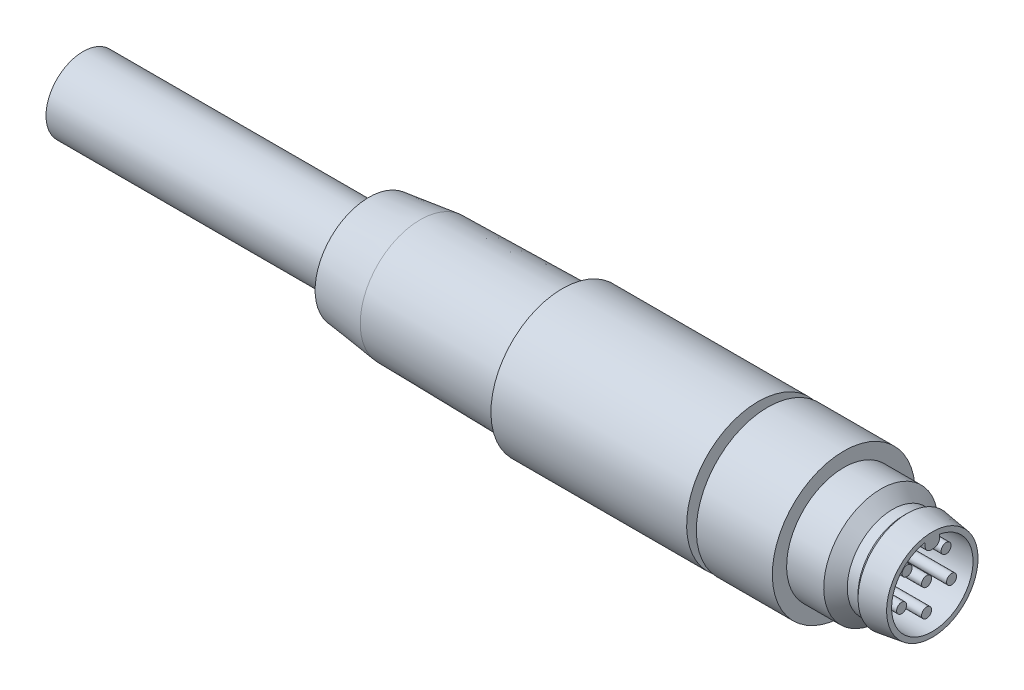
ISO-10303-21;
HEADER;
FILE_DESCRIPTION(('STEP AP214'),'2;1');
FILE_NAME('part.step','',(''),(''),'','','');
FILE_SCHEMA(('AUTOMOTIVE_DESIGN { 1 0 10303 214 1 1 1 1 }'));
ENDSEC;
DATA;
#1=APPLICATION_CONTEXT('core data for automotive mechanical design processes');
#2=APPLICATION_PROTOCOL_DEFINITION('international standard','automotive_design',2000,#1);
#3=PRODUCT_CONTEXT('',#1,'mechanical');
#4=PRODUCT('Part','Part','',(#3));
#5=PRODUCT_RELATED_PRODUCT_CATEGORY('part','',(#4));
#6=PRODUCT_DEFINITION_FORMATION('','',#4);
#7=PRODUCT_DEFINITION_CONTEXT('part definition',#1,'design');
#8=PRODUCT_DEFINITION('design','',#6,#7);
#9=PRODUCT_DEFINITION_SHAPE('','',#8);
#10=(LENGTH_UNIT() NAMED_UNIT(*) SI_UNIT(.MILLI.,.METRE.));
#11=(NAMED_UNIT(*) PLANE_ANGLE_UNIT() SI_UNIT($,.RADIAN.));
#12=(NAMED_UNIT(*) SI_UNIT($,.STERADIAN.) SOLID_ANGLE_UNIT());
#13=UNCERTAINTY_MEASURE_WITH_UNIT(LENGTH_MEASURE(1.E-05),#10,'distance_accuracy_value','');
#14=(GEOMETRIC_REPRESENTATION_CONTEXT(3) GLOBAL_UNCERTAINTY_ASSIGNED_CONTEXT((#13)) GLOBAL_UNIT_ASSIGNED_CONTEXT((#10,
#11,#12)) REPRESENTATION_CONTEXT('',''));
#15=CARTESIAN_POINT('',(0.,0.,0.));
#16=DIRECTION('',(0.,0.,1.));
#17=DIRECTION('',(1.,0.,0.));
#18=AXIS2_PLACEMENT_3D('',#15,#16,#17);
#19=CARTESIAN_POINT('',(1.22065556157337,2.15,0.5));
#20=DIRECTION('',(0.,1.,0.));
#21=DIRECTION('',(-1.,0.,0.));
#22=AXIS2_PLACEMENT_3D('',#19,#20,#21);
#23=PLANE('',#22);
#24=DIRECTION('',(-1.,0.,0.));
#25=VECTOR('',#24,1.);
#26=CARTESIAN_POINT('',(1.22065556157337,2.15,0.1));
#27=LINE('',#26,#25);
#28=CARTESIAN_POINT('',(-5.,2.15,0.1));
#29=VERTEX_POINT('',#28);
#30=CARTESIAN_POINT('',(0.,2.15,0.1));
#31=VERTEX_POINT('',#30);
#32=EDGE_CURVE('E102',#29,#31,#27,.F.);
#33=ORIENTED_EDGE('',*,*,#32,.F.);
#34=DIRECTION('',(0.,0.,1.));
#35=VECTOR('',#34,1.);
#36=CARTESIAN_POINT('',(-5.,2.15,0.5));
#37=LINE('',#36,#35);
#38=CARTESIAN_POINT('',(-5.,2.15,-0.1));
#39=VERTEX_POINT('',#38);
#40=EDGE_CURVE('E108',#39,#29,#37,.T.);
#41=ORIENTED_EDGE('',*,*,#40,.F.);
#42=DIRECTION('',(-1.,0.,0.));
#43=VECTOR('',#42,1.);
#44=CARTESIAN_POINT('',(1.22065556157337,2.15,-0.1));
#45=LINE('',#44,#43);
#46=CARTESIAN_POINT('',(0.,2.15,-0.1));
#47=VERTEX_POINT('',#46);
#48=EDGE_CURVE('E74',#47,#39,#45,.T.);
#49=ORIENTED_EDGE('',*,*,#48,.F.);
#50=DIRECTION('',(0.,0.,1.));
#51=VECTOR('',#50,1.);
#52=CARTESIAN_POINT('',(0.,2.15,0.5));
#53=LINE('',#52,#51);
#54=EDGE_CURVE('E69',#31,#47,#53,.F.);
#55=ORIENTED_EDGE('',*,*,#54,.F.);
#56=EDGE_LOOP('',(#33,#41,#49,#55));
#57=FACE_BOUND('',#56,.T.);
#58=ADVANCED_FACE('F15',(#57),#23,.F.);
#59=CARTESIAN_POINT('',(-0.4,-0.742,-1.74912435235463));
#60=DIRECTION('',(1.,0.,0.));
#61=DIRECTION('',(0.,1.,0.));
#62=AXIS2_PLACEMENT_3D('',#59,#60,#61);
#63=PLANE('',#62);
#64=CARTESIAN_POINT('',(-0.4,-0.742,-1.74912435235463));
#65=DIRECTION('',(-1.,0.,0.));
#66=DIRECTION('',(0.,-1.,0.));
#67=AXIS2_PLACEMENT_3D('',#64,#65,#66);
#68=CIRCLE('',#67,0.35);
#69=CARTESIAN_POINT('',(-0.4,-1.092,-1.74912435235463));
#70=VERTEX_POINT('',#69);
#71=EDGE_CURVE('E106',#70,#70,#68,.T.);
#72=ORIENTED_EDGE('',*,*,#71,.F.);
#73=EDGE_LOOP('',(#72));
#74=FACE_BOUND('',#73,.T.);
#75=ADVANCED_FACE('F582',(#74),#63,.T.);
#76=CARTESIAN_POINT('',(-0.4,-0.742,1.74912435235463));
#77=DIRECTION('',(1.,0.,0.));
#78=DIRECTION('',(0.,1.,0.));
#79=AXIS2_PLACEMENT_3D('',#76,#77,#78);
#80=PLANE('',#79);
#81=CARTESIAN_POINT('',(-0.4,-0.742,1.74912435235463));
#82=DIRECTION('',(-1.,0.,0.));
#83=DIRECTION('',(0.,-1.,0.));
#84=AXIS2_PLACEMENT_3D('',#81,#82,#83);
#85=CIRCLE('',#84,0.35);
#86=CARTESIAN_POINT('',(-0.4,-1.092,1.74912435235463));
#87=VERTEX_POINT('',#86);
#88=EDGE_CURVE('E209',#87,#87,#85,.T.);
#89=ORIENTED_EDGE('',*,*,#88,.F.);
#90=EDGE_LOOP('',(#89));
#91=FACE_BOUND('',#90,.T.);
#92=ADVANCED_FACE('F573',(#91),#80,.T.);
#93=CARTESIAN_POINT('',(-0.4,0.,0.));
#94=DIRECTION('',(1.,0.,0.));
#95=DIRECTION('',(0.,1.,0.));
#96=AXIS2_PLACEMENT_3D('',#93,#94,#95);
#97=PLANE('',#96);
#98=CARTESIAN_POINT('',(-0.4,0.,0.));
#99=DIRECTION('',(-1.,0.,0.));
#100=DIRECTION('',(0.,-1.,0.));
#101=AXIS2_PLACEMENT_3D('',#98,#99,#100);
#102=CIRCLE('',#101,0.35);
#103=CARTESIAN_POINT('',(-0.4,-0.35,0.));
#104=VERTEX_POINT('',#103);
#105=EDGE_CURVE('E205',#104,#104,#102,.T.);
#106=ORIENTED_EDGE('',*,*,#105,.F.);
#107=EDGE_LOOP('',(#106));
#108=FACE_BOUND('',#107,.T.);
#109=ADVANCED_FACE('F564',(#108),#97,.T.);
#110=CARTESIAN_POINT('',(-0.4,1.32,1.36660162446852));
#111=DIRECTION('',(1.,0.,0.));
#112=DIRECTION('',(0.,1.,0.));
#113=AXIS2_PLACEMENT_3D('',#110,#111,#112);
#114=PLANE('',#113);
#115=CARTESIAN_POINT('',(-0.4,1.32,1.36660162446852));
#116=DIRECTION('',(-1.,0.,0.));
#117=DIRECTION('',(0.,-1.,0.));
#118=AXIS2_PLACEMENT_3D('',#115,#116,#117);
#119=CIRCLE('',#118,0.35);
#120=CARTESIAN_POINT('',(-0.4,0.97,1.36660162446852));
#121=VERTEX_POINT('',#120);
#122=EDGE_CURVE('E201',#121,#121,#119,.T.);
#123=ORIENTED_EDGE('',*,*,#122,.F.);
#124=EDGE_LOOP('',(#123));
#125=FACE_BOUND('',#124,.T.);
#126=ADVANCED_FACE('F555',(#125),#114,.T.);
#127=CARTESIAN_POINT('',(-0.4,-1.9,0.));
#128=DIRECTION('',(1.,0.,0.));
#129=DIRECTION('',(0.,1.,0.));
#130=AXIS2_PLACEMENT_3D('',#127,#128,#129);
#131=PLANE('',#130);
#132=CARTESIAN_POINT('',(-0.4,-1.9,0.));
#133=DIRECTION('',(-1.,0.,0.));
#134=DIRECTION('',(0.,-1.,0.));
#135=AXIS2_PLACEMENT_3D('',#132,#133,#134);
#136=CIRCLE('',#135,0.35);
#137=CARTESIAN_POINT('',(-0.4,-2.25,0.));
#138=VERTEX_POINT('',#137);
#139=EDGE_CURVE('E197',#138,#138,#136,.T.);
#140=ORIENTED_EDGE('',*,*,#139,.F.);
#141=EDGE_LOOP('',(#140));
#142=FACE_BOUND('',#141,.T.);
#143=ADVANCED_FACE('F546',(#142),#131,.T.);
#144=CARTESIAN_POINT('',(-0.4,1.32,-1.36660162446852));
#145=DIRECTION('',(1.,0.,0.));
#146=DIRECTION('',(0.,1.,0.));
#147=AXIS2_PLACEMENT_3D('',#144,#145,#146);
#148=PLANE('',#147);
#149=CARTESIAN_POINT('',(-0.4,1.32,-1.36660162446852));
#150=DIRECTION('',(-1.,0.,0.));
#151=DIRECTION('',(0.,-1.,0.));
#152=AXIS2_PLACEMENT_3D('',#149,#150,#151);
#153=CIRCLE('',#152,0.35);
#154=CARTESIAN_POINT('',(-0.4,0.97,-1.36660162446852));
#155=VERTEX_POINT('',#154);
#156=EDGE_CURVE('E83',#155,#155,#153,.T.);
#157=ORIENTED_EDGE('',*,*,#156,.F.);
#158=EDGE_LOOP('',(#157));
#159=FACE_BOUND('',#158,.T.);
#160=ADVANCED_FACE('F538',(#159),#148,.T.);
#161=CARTESIAN_POINT('',(1.22065556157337,2.55,-0.1));
#162=DIRECTION('',(-1.,0.,0.));
#163=DIRECTION('',(0.,-1.,0.));
#164=AXIS2_PLACEMENT_3D('',#161,#162,#163);
#165=CYLINDRICAL_SURFACE('',#164,0.4);
#166=CARTESIAN_POINT('',(-5.,2.55,-0.1));
#167=DIRECTION('',(-1.,0.,0.));
#168=DIRECTION('',(0.,-1.,0.));
#169=AXIS2_PLACEMENT_3D('',#166,#167,#168);
#170=CIRCLE('',#169,0.4);
#171=CARTESIAN_POINT('',(-5.,2.55,-0.5));
#172=VERTEX_POINT('',#171);
#173=EDGE_CURVE('E79',#39,#172,#170,.F.);
#174=ORIENTED_EDGE('',*,*,#173,.T.);
#175=DIRECTION('',(1.,0.,0.));
#176=VECTOR('',#175,1.);
#177=CARTESIAN_POINT('',(1.22065556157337,2.55,-0.5));
#178=LINE('',#177,#176);
#179=CARTESIAN_POINT('',(0.,2.55,-0.5));
#180=VERTEX_POINT('',#179);
#181=EDGE_CURVE('E76',#172,#180,#178,.T.);
#182=ORIENTED_EDGE('',*,*,#181,.T.);
#183=CARTESIAN_POINT('',(0.,2.55,-0.1));
#184=DIRECTION('',(-1.,0.,0.));
#185=DIRECTION('',(0.,-1.,0.));
#186=AXIS2_PLACEMENT_3D('',#183,#184,#185);
#187=CIRCLE('',#186,0.4);
#188=EDGE_CURVE('E18',#180,#47,#187,.T.);
#189=ORIENTED_EDGE('',*,*,#188,.T.);
#190=ORIENTED_EDGE('',*,*,#48,.T.);
#191=EDGE_LOOP('',(#174,#182,#189,#190));
#192=FACE_BOUND('',#191,.T.);
#193=ADVANCED_FACE('F77',(#192),#165,.T.);
#194=CARTESIAN_POINT('',(1.22065556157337,2.55,0.1));
#195=DIRECTION('',(-1.,0.,0.));
#196=DIRECTION('',(0.,-1.,0.));
#197=AXIS2_PLACEMENT_3D('',#194,#195,#196);
#198=CYLINDRICAL_SURFACE('',#197,0.4);
#199=CARTESIAN_POINT('',(-5.,2.55,0.1));
#200=DIRECTION('',(-1.,0.,0.));
#201=DIRECTION('',(0.,-1.,0.));
#202=AXIS2_PLACEMENT_3D('',#199,#200,#201);
#203=CIRCLE('',#202,0.4);
#204=CARTESIAN_POINT('',(-5.,2.55,0.5));
#205=VERTEX_POINT('',#204);
#206=EDGE_CURVE('E107',#205,#29,#203,.F.);
#207=ORIENTED_EDGE('',*,*,#206,.T.);
#208=ORIENTED_EDGE('',*,*,#32,.T.);
#209=CARTESIAN_POINT('',(0.,2.55,0.1));
#210=DIRECTION('',(-1.,0.,0.));
#211=DIRECTION('',(0.,-1.,0.));
#212=AXIS2_PLACEMENT_3D('',#209,#210,#211);
#213=CIRCLE('',#212,0.4);
#214=CARTESIAN_POINT('',(0.,2.55,0.5));
#215=VERTEX_POINT('',#214);
#216=EDGE_CURVE('E219',#31,#215,#213,.T.);
#217=ORIENTED_EDGE('',*,*,#216,.T.);
#218=DIRECTION('',(-1.,0.,0.));
#219=VECTOR('',#218,1.);
#220=CARTESIAN_POINT('',(1.22065556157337,2.55,0.5));
#221=LINE('',#220,#219);
#222=EDGE_CURVE('E94',#215,#205,#221,.T.);
#223=ORIENTED_EDGE('',*,*,#222,.T.);
#224=EDGE_LOOP('',(#207,#208,#217,#223));
#225=FACE_BOUND('',#224,.T.);
#226=ADVANCED_FACE('F227',(#225),#198,.T.);
#227=CARTESIAN_POINT('',(-0.4,-0.742,-1.74912435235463));
#228=DIRECTION('',(-1.,0.,0.));
#229=DIRECTION('',(0.,-1.,0.));
#230=AXIS2_PLACEMENT_3D('',#227,#228,#229);
#231=CYLINDRICAL_SURFACE('',#230,0.35);
#232=CARTESIAN_POINT('',(-5.,-0.742,-1.74912435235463));
#233=DIRECTION('',(-1.,0.,0.));
#234=DIRECTION('',(0.,-1.,0.));
#235=AXIS2_PLACEMENT_3D('',#232,#233,#234);
#236=CIRCLE('',#235,0.35);
#237=CARTESIAN_POINT('',(-5.,-1.092,-1.74912435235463));
#238=VERTEX_POINT('',#237);
#239=EDGE_CURVE('E101',#238,#238,#236,.T.);
#240=ORIENTED_EDGE('',*,*,#239,.F.);
#241=EDGE_LOOP('',(#240));
#242=FACE_BOUND('',#241,.T.);
#243=ORIENTED_EDGE('',*,*,#71,.T.);
#244=EDGE_LOOP('',(#243));
#245=FACE_BOUND('',#244,.T.);
#246=ADVANCED_FACE('F514',(#242,#245),#231,.T.);
#247=CARTESIAN_POINT('',(-0.4,-0.742,1.74912435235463));
#248=DIRECTION('',(-1.,0.,0.));
#249=DIRECTION('',(0.,-1.,0.));
#250=AXIS2_PLACEMENT_3D('',#247,#248,#249);
#251=CYLINDRICAL_SURFACE('',#250,0.35);
#252=CARTESIAN_POINT('',(-5.,-0.742,1.74912435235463));
#253=DIRECTION('',(-1.,0.,0.));
#254=DIRECTION('',(0.,-1.,0.));
#255=AXIS2_PLACEMENT_3D('',#252,#253,#254);
#256=CIRCLE('',#255,0.35);
#257=CARTESIAN_POINT('',(-5.,-1.092,1.74912435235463));
#258=VERTEX_POINT('',#257);
#259=EDGE_CURVE('E187',#258,#258,#256,.T.);
#260=ORIENTED_EDGE('',*,*,#259,.F.);
#261=EDGE_LOOP('',(#260));
#262=FACE_BOUND('',#261,.T.);
#263=ORIENTED_EDGE('',*,*,#88,.T.);
#264=EDGE_LOOP('',(#263));
#265=FACE_BOUND('',#264,.T.);
#266=ADVANCED_FACE('F505',(#262,#265),#251,.T.);
#267=CARTESIAN_POINT('',(-0.4,0.,0.));
#268=DIRECTION('',(-1.,0.,0.));
#269=DIRECTION('',(0.,-1.,0.));
#270=AXIS2_PLACEMENT_3D('',#267,#268,#269);
#271=CYLINDRICAL_SURFACE('',#270,0.35);
#272=CARTESIAN_POINT('',(-5.,0.,0.));
#273=DIRECTION('',(-1.,0.,0.));
#274=DIRECTION('',(0.,-1.,0.));
#275=AXIS2_PLACEMENT_3D('',#272,#273,#274);
#276=CIRCLE('',#275,0.35);
#277=CARTESIAN_POINT('',(-5.,-0.350000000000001,0.));
#278=VERTEX_POINT('',#277);
#279=EDGE_CURVE('E182',#278,#278,#276,.T.);
#280=ORIENTED_EDGE('',*,*,#279,.F.);
#281=EDGE_LOOP('',(#280));
#282=FACE_BOUND('',#281,.T.);
#283=ORIENTED_EDGE('',*,*,#105,.T.);
#284=EDGE_LOOP('',(#283));
#285=FACE_BOUND('',#284,.T.);
#286=ADVANCED_FACE('F496',(#282,#285),#271,.T.);
#287=CARTESIAN_POINT('',(-0.4,1.32,1.36660162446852));
#288=DIRECTION('',(-1.,0.,0.));
#289=DIRECTION('',(0.,-1.,0.));
#290=AXIS2_PLACEMENT_3D('',#287,#288,#289);
#291=CYLINDRICAL_SURFACE('',#290,0.35);
#292=CARTESIAN_POINT('',(-5.,1.32,1.36660162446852));
#293=DIRECTION('',(-1.,0.,0.));
#294=DIRECTION('',(0.,-1.,0.));
#295=AXIS2_PLACEMENT_3D('',#292,#293,#294);
#296=CIRCLE('',#295,0.35);
#297=CARTESIAN_POINT('',(-5.,0.97,1.36660162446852));
#298=VERTEX_POINT('',#297);
#299=EDGE_CURVE('E177',#298,#298,#296,.T.);
#300=ORIENTED_EDGE('',*,*,#299,.F.);
#301=EDGE_LOOP('',(#300));
#302=FACE_BOUND('',#301,.T.);
#303=ORIENTED_EDGE('',*,*,#122,.T.);
#304=EDGE_LOOP('',(#303));
#305=FACE_BOUND('',#304,.T.);
#306=ADVANCED_FACE('F487',(#302,#305),#291,.T.);
#307=CARTESIAN_POINT('',(-0.4,-1.9,0.));
#308=DIRECTION('',(-1.,0.,0.));
#309=DIRECTION('',(0.,-1.,0.));
#310=AXIS2_PLACEMENT_3D('',#307,#308,#309);
#311=CYLINDRICAL_SURFACE('',#310,0.35);
#312=CARTESIAN_POINT('',(-5.,-1.9,0.));
#313=DIRECTION('',(-1.,0.,0.));
#314=DIRECTION('',(0.,-1.,0.));
#315=AXIS2_PLACEMENT_3D('',#312,#313,#314);
#316=CIRCLE('',#315,0.35);
#317=CARTESIAN_POINT('',(-5.,-2.25,0.));
#318=VERTEX_POINT('',#317);
#319=EDGE_CURVE('E173',#318,#318,#316,.T.);
#320=ORIENTED_EDGE('',*,*,#319,.F.);
#321=EDGE_LOOP('',(#320));
#322=FACE_BOUND('',#321,.T.);
#323=ORIENTED_EDGE('',*,*,#139,.T.);
#324=EDGE_LOOP('',(#323));
#325=FACE_BOUND('',#324,.T.);
#326=ADVANCED_FACE('F478',(#322,#325),#311,.T.);
#327=CARTESIAN_POINT('',(-0.4,1.32,-1.36660162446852));
#328=DIRECTION('',(-1.,0.,0.));
#329=DIRECTION('',(0.,-1.,0.));
#330=AXIS2_PLACEMENT_3D('',#327,#328,#329);
#331=CYLINDRICAL_SURFACE('',#330,0.35);
#332=CARTESIAN_POINT('',(-5.,1.32,-1.36660162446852));
#333=DIRECTION('',(-1.,0.,0.));
#334=DIRECTION('',(0.,-1.,0.));
#335=AXIS2_PLACEMENT_3D('',#332,#333,#334);
#336=CIRCLE('',#335,0.35);
#337=CARTESIAN_POINT('',(-5.,0.97,-1.36660162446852));
#338=VERTEX_POINT('',#337);
#339=EDGE_CURVE('E169',#338,#338,#336,.T.);
#340=ORIENTED_EDGE('',*,*,#339,.F.);
#341=EDGE_LOOP('',(#340));
#342=FACE_BOUND('',#341,.T.);
#343=ORIENTED_EDGE('',*,*,#156,.T.);
#344=EDGE_LOOP('',(#343));
#345=FACE_BOUND('',#344,.T.);
#346=ADVANCED_FACE('F470',(#342,#345),#331,.T.);
#347=CARTESIAN_POINT('',(1.22065556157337,2.15,-0.5));
#348=DIRECTION('',(0.,0.,1.));
#349=DIRECTION('',(1.,0.,0.));
#350=AXIS2_PLACEMENT_3D('',#347,#348,#349);
#351=PLANE('',#350);
#352=ORIENTED_EDGE('',*,*,#181,.F.);
#353=DIRECTION('',(0.,1.,0.));
#354=VECTOR('',#353,1.);
#355=CARTESIAN_POINT('',(-5.,0.,-0.5));
#356=LINE('',#355,#354);
#357=CARTESIAN_POINT('',(-5.,2.80579756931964,-0.5));
#358=VERTEX_POINT('',#357);
#359=EDGE_CURVE('E181',#358,#172,#356,.F.);
#360=ORIENTED_EDGE('',*,*,#359,.F.);
#361=DIRECTION('',(1.,0.,0.));
#362=VECTOR('',#361,1.);
#363=CARTESIAN_POINT('',(0.,2.80579756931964,-0.5));
#364=LINE('',#363,#362);
#365=CARTESIAN_POINT('',(0.,2.80579756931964,-0.5));
#366=VERTEX_POINT('',#365);
#367=EDGE_CURVE('E87',#358,#366,#364,.T.);
#368=ORIENTED_EDGE('',*,*,#367,.T.);
#369=DIRECTION('',(0.,1.,0.));
#370=VECTOR('',#369,1.);
#371=CARTESIAN_POINT('',(0.,2.15,-0.5));
#372=LINE('',#371,#370);
#373=EDGE_CURVE('E34',#180,#366,#372,.T.);
#374=ORIENTED_EDGE('',*,*,#373,.F.);
#375=EDGE_LOOP('',(#352,#360,#368,#374));
#376=FACE_BOUND('',#375,.T.);
#377=ADVANCED_FACE('F85',(#376),#351,.F.);
#378=CARTESIAN_POINT('',(1.22065556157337,2.80579756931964,0.5));
#379=DIRECTION('',(0.,0.,-1.));
#380=DIRECTION('',(-1.,0.,0.));
#381=AXIS2_PLACEMENT_3D('',#378,#379,#380);
#382=PLANE('',#381);
#383=ORIENTED_EDGE('',*,*,#222,.F.);
#384=DIRECTION('',(0.,1.,0.));
#385=VECTOR('',#384,1.);
#386=CARTESIAN_POINT('',(0.,2.80579756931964,0.5));
#387=LINE('',#386,#385);
#388=CARTESIAN_POINT('',(0.,2.80579756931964,0.5));
#389=VERTEX_POINT('',#388);
#390=EDGE_CURVE('E90',#389,#215,#387,.F.);
#391=ORIENTED_EDGE('',*,*,#390,.F.);
#392=DIRECTION('',(1.,0.,0.));
#393=VECTOR('',#392,1.);
#394=CARTESIAN_POINT('',(0.,2.80579756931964,0.5));
#395=LINE('',#394,#393);
#396=CARTESIAN_POINT('',(-5.,2.80579756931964,0.5));
#397=VERTEX_POINT('',#396);
#398=EDGE_CURVE('E168',#389,#397,#395,.F.);
#399=ORIENTED_EDGE('',*,*,#398,.T.);
#400=DIRECTION('',(0.,1.,0.));
#401=VECTOR('',#400,1.);
#402=CARTESIAN_POINT('',(-5.,0.,0.5));
#403=LINE('',#402,#401);
#404=EDGE_CURVE('E186',#205,#397,#403,.T.);
#405=ORIENTED_EDGE('',*,*,#404,.F.);
#406=EDGE_LOOP('',(#383,#391,#399,#405));
#407=FACE_BOUND('',#406,.T.);
#408=ADVANCED_FACE('F231',(#407),#382,.F.);
#409=CARTESIAN_POINT('',(-5.,0.,0.));
#410=DIRECTION('',(1.,0.,0.));
#411=DIRECTION('',(0.,1.,0.));
#412=AXIS2_PLACEMENT_3D('',#409,#410,#411);
#413=PLANE('',#412);
#414=ORIENTED_EDGE('',*,*,#339,.T.);
#415=EDGE_LOOP('',(#414));
#416=FACE_BOUND('',#415,.T.);
#417=ORIENTED_EDGE('',*,*,#319,.T.);
#418=EDGE_LOOP('',(#417));
#419=FACE_BOUND('',#418,.T.);
#420=ORIENTED_EDGE('',*,*,#299,.T.);
#421=EDGE_LOOP('',(#420));
#422=FACE_BOUND('',#421,.T.);
#423=ORIENTED_EDGE('',*,*,#359,.T.);
#424=ORIENTED_EDGE('',*,*,#173,.F.);
#425=ORIENTED_EDGE('',*,*,#40,.T.);
#426=ORIENTED_EDGE('',*,*,#206,.F.);
#427=ORIENTED_EDGE('',*,*,#404,.T.);
#428=CARTESIAN_POINT('',(-5.,0.,0.));
#429=DIRECTION('',(1.,0.,0.));
#430=DIRECTION('',(0.,1.,0.));
#431=AXIS2_PLACEMENT_3D('',#428,#429,#430);
#432=CIRCLE('',#431,2.85);
#433=EDGE_CURVE('E164',#397,#358,#432,.T.);
#434=ORIENTED_EDGE('',*,*,#433,.T.);
#435=EDGE_LOOP('',(#423,#424,#425,#426,#427,#434));
#436=FACE_BOUND('',#435,.T.);
#437=ORIENTED_EDGE('',*,*,#279,.T.);
#438=EDGE_LOOP('',(#437));
#439=FACE_BOUND('',#438,.T.);
#440=ORIENTED_EDGE('',*,*,#259,.T.);
#441=EDGE_LOOP('',(#440));
#442=FACE_BOUND('',#441,.T.);
#443=ORIENTED_EDGE('',*,*,#239,.T.);
#444=EDGE_LOOP('',(#443));
#445=FACE_BOUND('',#444,.T.);
#446=ADVANCED_FACE('F446',(#416,#419,#422,#436,#439,#442,#445),#413,.T.);
#447=CARTESIAN_POINT('',(0.,0.,0.));
#448=DIRECTION('',(1.,0.,0.));
#449=DIRECTION('',(0.,1.,0.));
#450=AXIS2_PLACEMENT_3D('',#447,#448,#449);
#451=CYLINDRICAL_SURFACE('',#450,2.85);
#452=ORIENTED_EDGE('',*,*,#398,.F.);
#453=CARTESIAN_POINT('',(0.,0.,0.));
#454=DIRECTION('',(1.,0.,0.));
#455=DIRECTION('',(0.,1.,0.));
#456=AXIS2_PLACEMENT_3D('',#453,#454,#455);
#457=CIRCLE('',#456,2.85);
#458=EDGE_CURVE('E161',#366,#389,#457,.F.);
#459=ORIENTED_EDGE('',*,*,#458,.F.);
#460=ORIENTED_EDGE('',*,*,#367,.F.);
#461=ORIENTED_EDGE('',*,*,#433,.F.);
#462=EDGE_LOOP('',(#452,#459,#460,#461));
#463=FACE_BOUND('',#462,.T.);
#464=ADVANCED_FACE('F438',(#463),#451,.F.);
#465=CARTESIAN_POINT('',(0.,2.85,0.));
#466=DIRECTION('',(1.,0.,0.));
#467=DIRECTION('',(0.,1.,0.));
#468=AXIS2_PLACEMENT_3D('',#465,#466,#467);
#469=PLANE('',#468);
#470=ORIENTED_EDGE('',*,*,#373,.T.);
#471=ORIENTED_EDGE('',*,*,#458,.T.);
#472=ORIENTED_EDGE('',*,*,#390,.T.);
#473=ORIENTED_EDGE('',*,*,#216,.F.);
#474=ORIENTED_EDGE('',*,*,#54,.T.);
#475=ORIENTED_EDGE('',*,*,#188,.F.);
#476=EDGE_LOOP('',(#470,#471,#472,#473,#474,#475));
#477=FACE_BOUND('',#476,.T.);
#478=CARTESIAN_POINT('',(0.,0.,0.));
#479=DIRECTION('',(-1.,0.,0.));
#480=DIRECTION('',(0.,-1.,0.));
#481=AXIS2_PLACEMENT_3D('',#478,#479,#480);
#482=CIRCLE('',#481,3.19999999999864);
#483=CARTESIAN_POINT('',(0.,-3.19999999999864,0.));
#484=VERTEX_POINT('',#483);
#485=EDGE_CURVE('E156',#484,#484,#482,.T.);
#486=ORIENTED_EDGE('',*,*,#485,.F.);
#487=EDGE_LOOP('',(#486));
#488=FACE_BOUND('',#487,.T.);
#489=ADVANCED_FACE('F66',(#477,#488),#469,.T.);
#490=CARTESIAN_POINT('',(-1.75000000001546,0.,0.));
#491=DIRECTION('',(-1.,0.,0.));
#492=DIRECTION('',(0.,-1.,0.));
#493=AXIS2_PLACEMENT_3D('',#490,#491,#492);
#494=CONICAL_SURFACE('',#493,3.45000000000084,0.141897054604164);
#495=ORIENTED_EDGE('',*,*,#485,.T.);
#496=EDGE_LOOP('',(#495));
#497=FACE_BOUND('',#496,.T.);
#498=CARTESIAN_POINT('',(-1.75000000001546,0.,0.));
#499=DIRECTION('',(1.,0.,0.));
#500=DIRECTION('',(0.,1.,0.));
#501=AXIS2_PLACEMENT_3D('',#498,#499,#500);
#502=CIRCLE('',#501,3.44999999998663);
#503=CARTESIAN_POINT('',(-1.75000000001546,3.44999999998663,0.));
#504=VERTEX_POINT('',#503);
#505=EDGE_CURVE('E160',#504,#504,#502,.F.);
#506=ORIENTED_EDGE('',*,*,#505,.F.);
#507=EDGE_LOOP('',(#506));
#508=FACE_BOUND('',#507,.T.);
#509=ADVANCED_FACE('F421',(#497,#508),#494,.T.);
#510=CARTESIAN_POINT('',(-1.75000000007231,0.,0.));
#511=DIRECTION('',(1.,0.,0.));
#512=DIRECTION('',(0.,1.,0.));
#513=AXIS2_PLACEMENT_3D('',#510,#511,#512);
#514=CONICAL_SURFACE('',#513,3.44999999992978,0.785398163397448);
#515=CARTESIAN_POINT('',(-2.025,0.,0.));
#516=DIRECTION('',(1.,0.,0.));
#517=DIRECTION('',(0.,1.,0.));
#518=AXIS2_PLACEMENT_3D('',#515,#516,#517);
#519=CIRCLE('',#518,3.175);
#520=CARTESIAN_POINT('',(-2.025,3.175,0.));
#521=VERTEX_POINT('',#520);
#522=EDGE_CURVE('E247',#521,#521,#519,.F.);
#523=ORIENTED_EDGE('',*,*,#522,.F.);
#524=EDGE_LOOP('',(#523));
#525=FACE_BOUND('',#524,.T.);
#526=ORIENTED_EDGE('',*,*,#505,.T.);
#527=EDGE_LOOP('',(#526));
#528=FACE_BOUND('',#527,.T.);
#529=ADVANCED_FACE('F412',(#525,#528),#514,.T.);
#530=CARTESIAN_POINT('',(0.,0.,0.));
#531=DIRECTION('',(1.,0.,0.));
#532=DIRECTION('',(0.,1.,0.));
#533=AXIS2_PLACEMENT_3D('',#530,#531,#532);
#534=CYLINDRICAL_SURFACE('',#533,3.175);
#535=CARTESIAN_POINT('',(-2.77799999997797,0.,0.));
#536=DIRECTION('',(-1.,0.,0.));
#537=DIRECTION('',(0.,-1.,0.));
#538=AXIS2_PLACEMENT_3D('',#535,#536,#537);
#539=CIRCLE('',#538,3.17499999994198);
#540=CARTESIAN_POINT('',(-2.77799999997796,-3.17499999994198,0.));
#541=VERTEX_POINT('',#540);
#542=EDGE_CURVE('E251',#541,#541,#539,.T.);
#543=ORIENTED_EDGE('',*,*,#542,.F.);
#544=EDGE_LOOP('',(#543));
#545=FACE_BOUND('',#544,.T.);
#546=ORIENTED_EDGE('',*,*,#522,.T.);
#547=EDGE_LOOP('',(#546));
#548=FACE_BOUND('',#547,.T.);
#549=ADVANCED_FACE('F403',(#545,#548),#534,.T.);
#550=CARTESIAN_POINT('',(-3.6029999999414,0.,0.));
#551=DIRECTION('',(-1.,0.,0.));
#552=DIRECTION('',(0.,-1.,0.));
#553=AXIS2_PLACEMENT_3D('',#550,#551,#552);
#554=CONICAL_SURFACE('',#553,3.99999999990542,0.785398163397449);
#555=ORIENTED_EDGE('',*,*,#542,.T.);
#556=EDGE_LOOP('',(#555));
#557=FACE_BOUND('',#556,.T.);
#558=CARTESIAN_POINT('',(-3.603,0.,0.));
#559=DIRECTION('',(1.,0.,0.));
#560=DIRECTION('',(0.,1.,0.));
#561=AXIS2_PLACEMENT_3D('',#558,#559,#560);
#562=CIRCLE('',#561,4.);
#563=CARTESIAN_POINT('',(-3.603,4.,0.));
#564=VERTEX_POINT('',#563);
#565=EDGE_CURVE('E155',#564,#564,#562,.F.);
#566=ORIENTED_EDGE('',*,*,#565,.F.);
#567=EDGE_LOOP('',(#566));
#568=FACE_BOUND('',#567,.T.);
#569=ADVANCED_FACE('F394',(#557,#568),#554,.T.);
#570=CARTESIAN_POINT('',(-59.45,2.6,0.));
#571=DIRECTION('',(-1.,0.,0.));
#572=DIRECTION('',(0.,-1.,0.));
#573=AXIS2_PLACEMENT_3D('',#570,#571,#572);
#574=PLANE('',#573);
#575=CARTESIAN_POINT('',(-59.45,0.,0.));
#576=DIRECTION('',(1.,0.,0.));
#577=DIRECTION('',(0.,1.,0.));
#578=AXIS2_PLACEMENT_3D('',#575,#576,#577);
#579=CIRCLE('',#578,2.6);
#580=CARTESIAN_POINT('',(-59.45,2.59999999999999,0.));
#581=VERTEX_POINT('',#580);
#582=EDGE_CURVE('E151',#581,#581,#579,.T.);
#583=ORIENTED_EDGE('',*,*,#582,.F.);
#584=EDGE_LOOP('',(#583));
#585=FACE_BOUND('',#584,.T.);
#586=ADVANCED_FACE('F385',(#585),#574,.T.);
#587=CARTESIAN_POINT('',(0.,0.,0.));
#588=DIRECTION('',(1.,0.,0.));
#589=DIRECTION('',(0.,1.,0.));
#590=AXIS2_PLACEMENT_3D('',#587,#588,#589);
#591=CYLINDRICAL_SURFACE('',#590,4.);
#592=CARTESIAN_POINT('',(-6.2,0.,0.));
#593=DIRECTION('',(1.,0.,0.));
#594=DIRECTION('',(0.,1.,0.));
#595=AXIS2_PLACEMENT_3D('',#592,#593,#594);
#596=CIRCLE('',#595,4.);
#597=CARTESIAN_POINT('',(-6.2,4.,0.));
#598=VERTEX_POINT('',#597);
#599=EDGE_CURVE('E147',#598,#598,#596,.F.);
#600=ORIENTED_EDGE('',*,*,#599,.F.);
#601=EDGE_LOOP('',(#600));
#602=FACE_BOUND('',#601,.T.);
#603=ORIENTED_EDGE('',*,*,#565,.T.);
#604=EDGE_LOOP('',(#603));
#605=FACE_BOUND('',#604,.T.);
#606=ADVANCED_FACE('F376',(#602,#605),#591,.T.);
#607=CARTESIAN_POINT('',(0.,0.,0.));
#608=DIRECTION('',(1.,0.,0.));
#609=DIRECTION('',(0.,1.,0.));
#610=AXIS2_PLACEMENT_3D('',#607,#608,#609);
#611=CYLINDRICAL_SURFACE('',#610,2.6);
#612=ORIENTED_EDGE('',*,*,#582,.T.);
#613=EDGE_LOOP('',(#612));
#614=FACE_BOUND('',#613,.T.);
#615=CARTESIAN_POINT('',(-39.45,0.,0.));
#616=DIRECTION('',(1.,0.,0.));
#617=DIRECTION('',(0.,1.,0.));
#618=AXIS2_PLACEMENT_3D('',#615,#616,#617);
#619=CIRCLE('',#618,2.6);
#620=CARTESIAN_POINT('',(-39.45,2.6,0.));
#621=VERTEX_POINT('',#620);
#622=EDGE_CURVE('E143',#621,#621,#619,.T.);
#623=ORIENTED_EDGE('',*,*,#622,.F.);
#624=EDGE_LOOP('',(#623));
#625=FACE_BOUND('',#624,.T.);
#626=ADVANCED_FACE('F367',(#614,#625),#611,.T.);
#627=CARTESIAN_POINT('',(-6.2,4.,0.));
#628=DIRECTION('',(1.,0.,0.));
#629=DIRECTION('',(0.,1.,0.));
#630=AXIS2_PLACEMENT_3D('',#627,#628,#629);
#631=PLANE('',#630);
#632=ORIENTED_EDGE('',*,*,#599,.T.);
#633=EDGE_LOOP('',(#632));
#634=FACE_BOUND('',#633,.T.);
#635=CARTESIAN_POINT('',(-6.2,0.,0.));
#636=DIRECTION('',(1.,0.,0.));
#637=DIRECTION('',(0.,1.,0.));
#638=AXIS2_PLACEMENT_3D('',#635,#636,#637);
#639=CIRCLE('',#638,5.);
#640=CARTESIAN_POINT('',(-6.2,5.,0.));
#641=VERTEX_POINT('',#640);
#642=EDGE_CURVE('E139',#641,#641,#639,.F.);
#643=ORIENTED_EDGE('',*,*,#642,.F.);
#644=EDGE_LOOP('',(#643));
#645=FACE_BOUND('',#644,.T.);
#646=ADVANCED_FACE('F359',(#634,#645),#631,.T.);
#647=CARTESIAN_POINT('',(-39.45,3.75797558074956,0.));
#648=DIRECTION('',(-1.,0.,0.));
#649=DIRECTION('',(0.,-1.,0.));
#650=AXIS2_PLACEMENT_3D('',#647,#648,#649);
#651=PLANE('',#650);
#652=CARTESIAN_POINT('',(-39.449999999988,0.,0.));
#653=DIRECTION('',(1.,0.,0.));
#654=DIRECTION('',(0.,0.,-1.));
#655=AXIS2_PLACEMENT_3D('',#652,#653,#654);
#656=CIRCLE('',#655,3.75797558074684);
#657=CARTESIAN_POINT('',(-39.449999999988,0.,-3.75797558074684));
#658=VERTEX_POINT('',#657);
#659=EDGE_CURVE('E135',#658,#658,#656,.T.);
#660=ORIENTED_EDGE('',*,*,#659,.F.);
#661=EDGE_LOOP('',(#660));
#662=FACE_BOUND('',#661,.T.);
#663=ORIENTED_EDGE('',*,*,#622,.T.);
#664=EDGE_LOOP('',(#663));
#665=FACE_BOUND('',#664,.T.);
#666=ADVANCED_FACE('F279',(#662,#665),#651,.T.);
#667=CARTESIAN_POINT('',(0.,0.,0.));
#668=DIRECTION('',(1.,0.,0.));
#669=DIRECTION('',(0.,1.,0.));
#670=AXIS2_PLACEMENT_3D('',#667,#668,#669);
#671=CYLINDRICAL_SURFACE('',#670,5.);
#672=CARTESIAN_POINT('',(-11.52,0.,0.));
#673=DIRECTION('',(1.,0.,0.));
#674=DIRECTION('',(0.,1.,0.));
#675=AXIS2_PLACEMENT_3D('',#672,#673,#674);
#676=CIRCLE('',#675,5.);
#677=CARTESIAN_POINT('',(-11.52,5.,0.));
#678=VERTEX_POINT('',#677);
#679=EDGE_CURVE('E131',#678,#678,#676,.F.);
#680=ORIENTED_EDGE('',*,*,#679,.F.);
#681=EDGE_LOOP('',(#680));
#682=FACE_BOUND('',#681,.T.);
#683=ORIENTED_EDGE('',*,*,#642,.T.);
#684=EDGE_LOOP('',(#683));
#685=FACE_BOUND('',#684,.T.);
#686=ADVANCED_FACE('F268',(#682,#685),#671,.T.);
#687=CARTESIAN_POINT('',(-35.8500000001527,0.,0.));
#688=DIRECTION('',(1.,0.,0.));
#689=DIRECTION('',(0.,0.,-1.));
#690=AXIS2_PLACEMENT_3D('',#687,#688,#689);
#691=CONICAL_SURFACE('',#690,4.19999999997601,0.122173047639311);
#692=ORIENTED_EDGE('',*,*,#659,.T.);
#693=EDGE_LOOP('',(#692));
#694=FACE_BOUND('',#693,.T.);
#695=CARTESIAN_POINT('',(-35.8499999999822,0.,0.));
#696=DIRECTION('',(1.,0.,0.));
#697=DIRECTION('',(0.,1.,0.));
#698=AXIS2_PLACEMENT_3D('',#695,#696,#697);
#699=CIRCLE('',#698,4.1999999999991);
#700=CARTESIAN_POINT('',(-35.8499999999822,4.1999999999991,0.));
#701=VERTEX_POINT('',#700);
#702=EDGE_CURVE('E130',#701,#701,#699,.T.);
#703=ORIENTED_EDGE('',*,*,#702,.F.);
#704=EDGE_LOOP('',(#703));
#705=FACE_BOUND('',#704,.T.);
#706=ADVANCED_FACE('F265',(#694,#705),#691,.T.);
#707=CARTESIAN_POINT('',(-11.52,5.,0.));
#708=DIRECTION('',(-1.,0.,0.));
#709=DIRECTION('',(0.,-1.,0.));
#710=AXIS2_PLACEMENT_3D('',#707,#708,#709);
#711=PLANE('',#710);
#712=ORIENTED_EDGE('',*,*,#679,.T.);
#713=EDGE_LOOP('',(#712));
#714=FACE_BOUND('',#713,.T.);
#715=CARTESIAN_POINT('',(-11.52,0.,0.));
#716=DIRECTION('',(1.,0.,0.));
#717=DIRECTION('',(0.,1.,0.));
#718=AXIS2_PLACEMENT_3D('',#715,#716,#717);
#719=CIRCLE('',#718,3.2);
#720=CARTESIAN_POINT('',(-11.52,3.2,0.));
#721=VERTEX_POINT('',#720);
#722=EDGE_CURVE('E126',#721,#721,#719,.F.);
#723=ORIENTED_EDGE('',*,*,#722,.F.);
#724=EDGE_LOOP('',(#723));
#725=FACE_BOUND('',#724,.T.);
#726=ADVANCED_FACE('F267',(#714,#725),#711,.T.);
#727=CARTESIAN_POINT('',(-25.8999999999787,0.,0.));
#728=DIRECTION('',(1.,0.,0.));
#729=DIRECTION('',(0.,0.,-1.));
#730=AXIS2_PLACEMENT_3D('',#727,#728,#729);
#731=CONICAL_SURFACE('',#730,4.37367789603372,0.0174532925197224);
#732=ORIENTED_EDGE('',*,*,#702,.T.);
#733=EDGE_LOOP('',(#732));
#734=FACE_BOUND('',#733,.T.);
#735=CARTESIAN_POINT('',(-25.8999999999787,0.,0.));
#736=DIRECTION('',(1.,0.,0.));
#737=DIRECTION('',(0.,0.,-1.));
#738=AXIS2_PLACEMENT_3D('',#735,#736,#737);
#739=CIRCLE('',#738,4.37367789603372);
#740=CARTESIAN_POINT('',(-25.8999999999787,0.,-4.37367789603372));
#741=VERTEX_POINT('',#740);
#742=EDGE_CURVE('E122',#741,#741,#739,.T.);
#743=ORIENTED_EDGE('',*,*,#742,.F.);
#744=EDGE_LOOP('',(#743));
#745=FACE_BOUND('',#744,.T.);
#746=ADVANCED_FACE('F262',(#734,#745),#731,.T.);
#747=CARTESIAN_POINT('',(0.,0.,0.));
#748=DIRECTION('',(1.,0.,0.));
#749=DIRECTION('',(0.,1.,0.));
#750=AXIS2_PLACEMENT_3D('',#747,#748,#749);
#751=CYLINDRICAL_SURFACE('',#750,3.2);
#752=CARTESIAN_POINT('',(-12.2,0.,0.));
#753=DIRECTION('',(1.,0.,0.));
#754=DIRECTION('',(0.,1.,0.));
#755=AXIS2_PLACEMENT_3D('',#752,#753,#754);
#756=CIRCLE('',#755,3.2);
#757=CARTESIAN_POINT('',(-12.2,3.2,0.));
#758=VERTEX_POINT('',#757);
#759=EDGE_CURVE('E118',#758,#758,#756,.F.);
#760=ORIENTED_EDGE('',*,*,#759,.F.);
#761=EDGE_LOOP('',(#760));
#762=FACE_BOUND('',#761,.T.);
#763=ORIENTED_EDGE('',*,*,#722,.T.);
#764=EDGE_LOOP('',(#763));
#765=FACE_BOUND('',#764,.T.);
#766=ADVANCED_FACE('F298',(#762,#765),#751,.T.);
#767=CARTESIAN_POINT('',(-25.9,5.,0.));
#768=DIRECTION('',(-1.,0.,0.));
#769=DIRECTION('',(0.,-1.,0.));
#770=AXIS2_PLACEMENT_3D('',#767,#768,#769);
#771=PLANE('',#770);
#772=CARTESIAN_POINT('',(-25.9,0.,0.));
#773=DIRECTION('',(1.,0.,0.));
#774=DIRECTION('',(0.,1.,0.));
#775=AXIS2_PLACEMENT_3D('',#772,#773,#774);
#776=CIRCLE('',#775,5.);
#777=CARTESIAN_POINT('',(-25.9,5.,0.));
#778=VERTEX_POINT('',#777);
#779=EDGE_CURVE('E25',#778,#778,#776,.T.);
#780=ORIENTED_EDGE('',*,*,#779,.F.);
#781=EDGE_LOOP('',(#780));
#782=FACE_BOUND('',#781,.T.);
#783=ORIENTED_EDGE('',*,*,#742,.T.);
#784=EDGE_LOOP('',(#783));
#785=FACE_BOUND('',#784,.T.);
#786=ADVANCED_FACE('F291',(#782,#785),#771,.T.);
#787=CARTESIAN_POINT('',(-12.2,3.2,0.));
#788=DIRECTION('',(1.,0.,0.));
#789=DIRECTION('',(0.,1.,0.));
#790=AXIS2_PLACEMENT_3D('',#787,#788,#789);
#791=PLANE('',#790);
#792=ORIENTED_EDGE('',*,*,#759,.T.);
#793=EDGE_LOOP('',(#792));
#794=FACE_BOUND('',#793,.T.);
#795=CARTESIAN_POINT('',(-12.2,0.,0.));
#796=DIRECTION('',(1.,0.,0.));
#797=DIRECTION('',(0.,1.,0.));
#798=AXIS2_PLACEMENT_3D('',#795,#796,#797);
#799=CIRCLE('',#798,5.);
#800=CARTESIAN_POINT('',(-12.2,5.,0.));
#801=VERTEX_POINT('',#800);
#802=EDGE_CURVE('E9',#801,#801,#799,.F.);
#803=ORIENTED_EDGE('',*,*,#802,.F.);
#804=EDGE_LOOP('',(#803));
#805=FACE_BOUND('',#804,.T.);
#806=ADVANCED_FACE('F284',(#794,#805),#791,.T.);
#807=CARTESIAN_POINT('',(0.,0.,0.));
#808=DIRECTION('',(1.,0.,0.));
#809=DIRECTION('',(0.,1.,0.));
#810=AXIS2_PLACEMENT_3D('',#807,#808,#809);
#811=CYLINDRICAL_SURFACE('',#810,5.);
#812=ORIENTED_EDGE('',*,*,#779,.T.);
#813=EDGE_LOOP('',(#812));
#814=FACE_BOUND('',#813,.T.);
#815=ORIENTED_EDGE('',*,*,#802,.T.);
#816=EDGE_LOOP('',(#815));
#817=FACE_BOUND('',#816,.T.);
#818=ADVANCED_FACE('F282',(#814,#817),#811,.T.);
#819=CLOSED_SHELL('',(#58,#75,#92,#109,#126,#143,#160,#193,#226,#246,#266,#286,#306,#326,#346,
#377,#408,#446,#464,#489,#509,#529,#549,#569,#586,#606,#626,#646,#666,#686,#706,#726,#746,#766,
#786,#806,#818));
#820=MANIFOLD_SOLID_BREP('B1',#819);
#821=ADVANCED_BREP_SHAPE_REPRESENTATION('',(#18,#820),#14);
#822=SHAPE_DEFINITION_REPRESENTATION(#9,#821);
ENDSEC;
END-ISO-10303-21;
